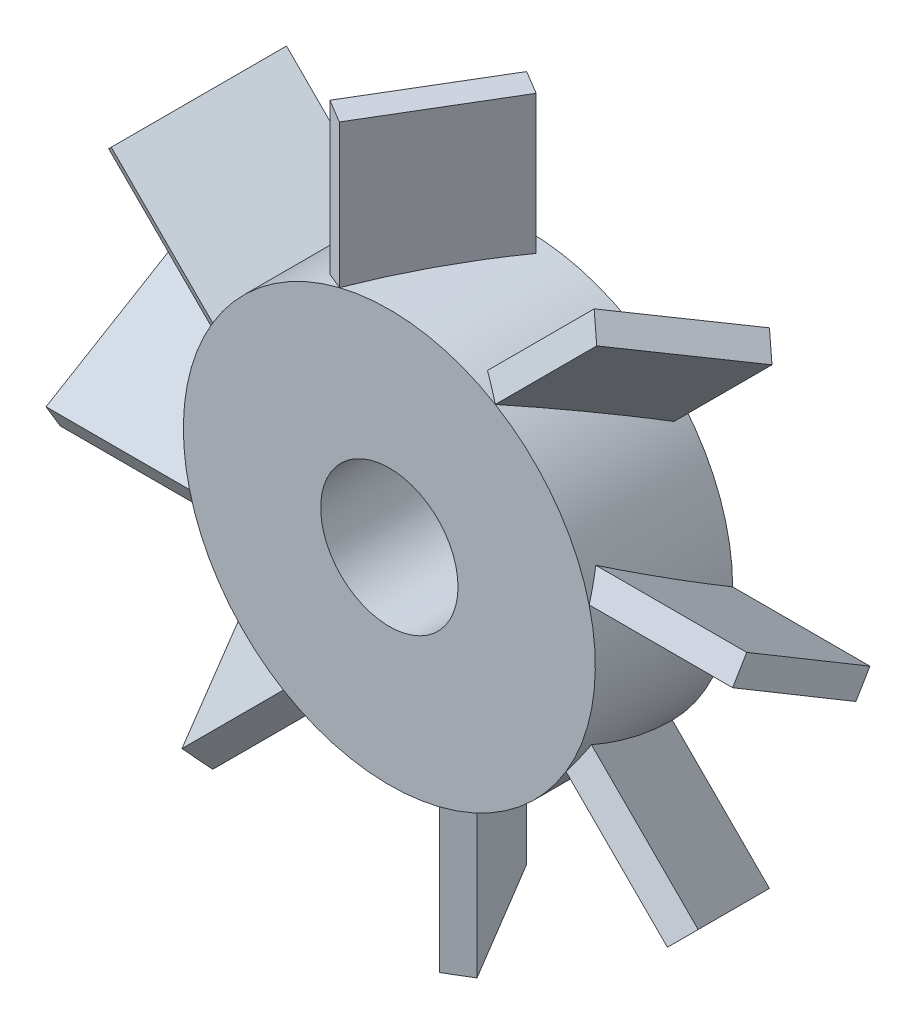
from build123d import *
from build123d.topology import SkipClean

# Parameters (mm, degrees)
SKETCH1_R           = 7.5
BASE_EXTRUDE_DEPTH  = 5
BOSS_EXTRUDE1_DEPTH = 12.5
CIRPATTERN1_COUNT   = 8
SKETCH3_R           = 2.5
CUT_EXTRUDE1_DEPTH  = 19.371173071


with BuildPart() as part:
    # Sketch1 → Base-Extrude (new body)
    with BuildSketch(Plane.XY):
        Circle(SKETCH1_R)
    extrude(amount=BASE_EXTRUDE_DEPTH)

    # Sketch2 → Boss-Extrude1 (add)
    with SkipClean():  # the faces are left unmerged after this step: merging them gives an invalid solid
        with BuildSketch(Plane(origin=(0, 0, 0), x_dir=(1, 0, 0), z_dir=(0, 1, 0))):
            Polygon((0, 0), (-2.678520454, -4.48746994), (-1.819851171, -5), (0.858669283, -0.51253006), align=None)
        boss_extrude1 = extrude(amount=BOSS_EXTRUDE1_DEPTH)

    # CirPattern1: Boss-Extrude1 ×8 about axis
    cirpattern1_axis = Axis((0, 0, 0), (0, 0, -1))
    for i in range(1, CIRPATTERN1_COUNT):
        add(boss_extrude1.rotate(cirpattern1_axis, i * 360 / CIRPATTERN1_COUNT))

    # Sketch3 → Cut-Extrude1 (cut, through all)
    with BuildSketch(Plane.XY.offset(5)):
        Circle(SKETCH3_R)
    extrude(amount=-CUT_EXTRUDE1_DEPTH, mode=Mode.SUBTRACT)


solid = part.part
